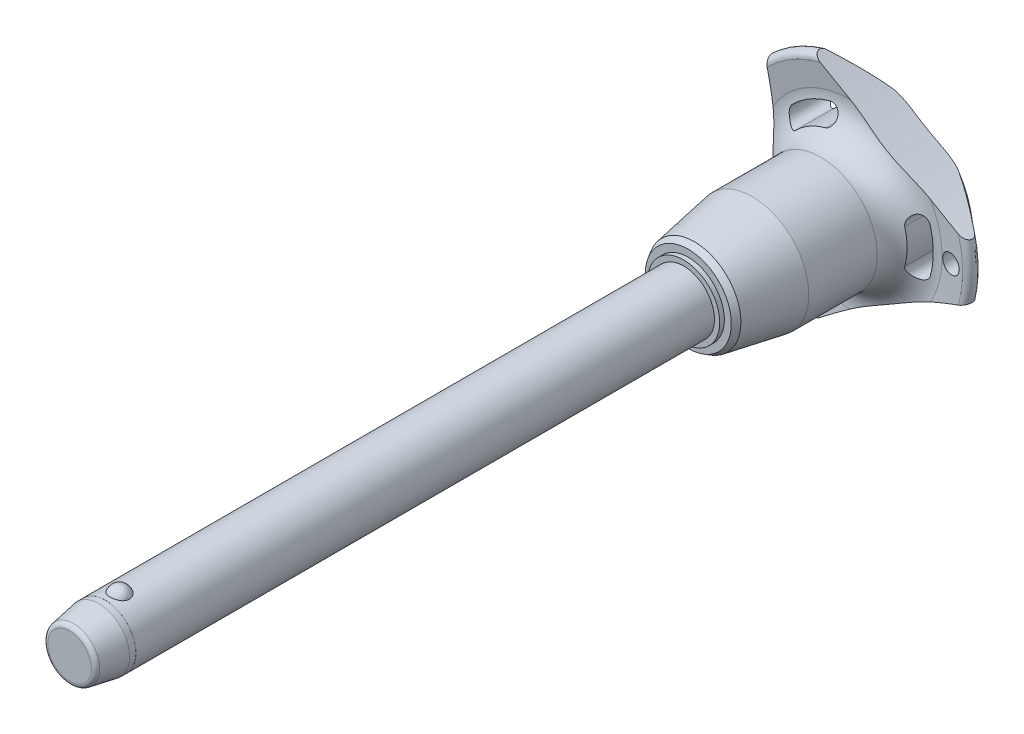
from build123d import *

# Parameters (mm, degrees)
SKETCH1_R           = 5
BOSS_EXTRUDE1_DEPTH = 90
SKETCH2_R           = 4.25
BOSS_EXTRUDE2_DEPTH = 33.3
BOSS_EXTRUDE3_START = 9.6
SKETCH1_2_R         = 5
BOSS_EXTRUDE3_DEPTH = 9.6
CHAMFER1_SIZE       = 4.8
CHAMFER1_SIZE2      = 0.846369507
FILLET1_R           = 0.75
SKETCH6_R           = 102.8
CUT_EXTRUDE1_DEPTH  = 127.380768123
CIRPATTERN1_COUNT   = 3
SKETCH7_R           = 1.5
CUT_EXTRUDE2_DEPTH  = 127.252726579
SKETCH8_R           = 5
SKETCH8_R_2         = 4.99
CUT_EXTRUDE3_DEPTH  = 5.76


with BuildPart() as part:
    # Sketch1 → Boss-Extrude1 (new body)
    with BuildSketch(Plane.XY):
        Circle(SKETCH1_R)
    extrude(amount=-BOSS_EXTRUDE1_DEPTH)

    # Sketch2 → Boss-Extrude2 (add)
    with BuildSketch(Plane(origin=(0, 0, -90), x_dir=(-1, 0, 0), z_dir=(0, 0, -1))):
        Circle(SKETCH2_R)
    extrude(amount=BOSS_EXTRUDE2_DEPTH)

    # Sketch3 → Revolve1 (revolve)
    with BuildSketch(Plane(origin=(0, 0, 0), x_dir=(0, 0, -1), z_dir=(1, 0, 0))):
        with BuildLine():
            Line((-1.516575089, 6), (-1.516575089, 2.7))
            ThreePointArc((-1.516575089, 2.7), (0.133424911, 4.35), (-1.516575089, 6))
        make_face()
        with BuildLine():
            Line((-1.516575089, -2.7), (-1.516575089, -6))
            ThreePointArc((-1.516575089, -6), (0.133424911, -4.35), (-1.516575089, -2.7))
        make_face()
    revolve(axis=Axis((0, -2.7, 1.516575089), (0, 1, 0)))

    # Sketch1_2 → Boss-Extrude3 (add)
    with BuildSketch(Plane.XY.offset(BOSS_EXTRUDE3_START)):
        Circle(SKETCH1_2_R)
    extrude(amount=-BOSS_EXTRUDE3_DEPTH)

    # Chamfer1
    chamfer1_edges = [part.edges().sort_by_distance(p)[0] for p in [
        (-5, 0, 9.6),
    ]]
    chamfer1_side = [part.faces().sort_by_distance(p)[0] for p in [
        (-5, 0, -40.2),
    ]]
    chamfer(chamfer1_edges, length=CHAMFER1_SIZE, length2=CHAMFER1_SIZE2, reference=chamfer1_side[0])

    # Fillet1
    fillet1_edges = [part.edges().sort_by_distance(p)[0] for p in [
        (-4.153630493, 0, 9.6),
        (4.25, 0, -123.3),
    ]]
    fillet(fillet1_edges, radius=FILLET1_R)

    # Sketch4 → Revolve2 (revolve)
    with BuildSketch(Plane(origin=(0, 0, 0), x_dir=(0, 0, -1), z_dir=(1, 0, 0)), mode=Mode.PRIVATE) as revolve2_sk:
        Polygon((90, 0), (90, 5.848880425), (90.75, 5.848880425), (90.75, 6.981619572), (91.730980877, 7.547989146), (101.1, 9.2), (112.2, 9.2), (112.2, 0), align=None)
    revolve(revolve2_sk.sketch.rotate(Axis((0, 0, -112.2), (0, 0, 1)), 90), axis=Axis((0, 0, -112.2), (0, 0, 1)))

    # Sketch5 → Revolve3 (revolve)
    with BuildSketch(Plane(origin=(0, 0, 0), x_dir=(0, 0, -1), z_dir=(1, 0, 0)), mode=Mode.PRIVATE) as revolve3_sk:
        with BuildLine():
            Line((117.169704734, 14.749576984), (116.756059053, 18.490084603))
            ThreePointArc((116.756059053, 18.490084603), (117.35677658, 19.519442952), (118.516044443, 19.24278761))
            Line((118.516044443, 19.24278761), (122.835691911, 14.094832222))
            ThreePointArc((122.835691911, 14.094832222), (123.3, 12.689260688), (122.67067517, 11.349423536))
            ThreePointArc((122.67067517, 11.349423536), (119.033110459, 6.185112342), (117.75, 0))
            Line((117.75, 0), (112.2, 0))
            Line((112.2, 0), (112.2, 9.2))
            ThreePointArc((112.2, 9.2), (115.924774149, 10.864425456), (117.169704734, 14.749576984))
        make_face()
    revolve(revolve3_sk.sketch.rotate(Axis((0, 0, -117.75), (0, 0, 1)), 90), axis=Axis((0, 0, -117.75), (0, 0, 1)))

    # Sketch6 → Cut-Extrude1 (cut, through all)
    with BuildSketch(Plane.XY):
        with Locations((-115.2, 0)):
            Circle(SKETCH6_R)
        with BuildLine():
            ThreePointArc((12.885043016, -3.538869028), (13.362182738, 0), (12.885043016, 3.538869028))
            ThreePointArc((12.885043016, 3.538869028), (11.179749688, 4.509281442), (10.209337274, 2.803988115))
            ThreePointArc((10.209337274, 2.803988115), (10.587394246, 0), (10.209337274, -2.803988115))
            ThreePointArc((10.209337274, -2.803988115), (11.179749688, -4.509281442), (12.885043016, -3.538869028))
        make_face()
    cut_extrude1 = extrude(amount=-CUT_EXTRUDE1_DEPTH, mode=Mode.SUBTRACT)

    # CirPattern1: Cut-Extrude1 ×3 about axis
    cirpattern1_axis = Axis((0, 0, 0), (0, 0, 1))
    for i in range(1, CIRPATTERN1_COUNT):
        add(cut_extrude1.rotate(cirpattern1_axis, i * 360 / CIRPATTERN1_COUNT), mode=Mode.SUBTRACT)

    # Sketch7 → Cut-Extrude2 (cut, through all)
    with BuildSketch(Plane.XY):
        with Locations(Location((16.362182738, 0, 0), (0, 0, 225.449470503))):
            Circle(SKETCH7_R)
    extrude(amount=-CUT_EXTRUDE2_DEPTH, mode=Mode.SUBTRACT)

    # Sketch8 → Cut-Extrude3 (cut)
    with BuildSketch(Plane.XY.offset(9.6)):
        Circle(SKETCH8_R)
        Circle(SKETCH8_R_2, mode=Mode.SUBTRACT)
    extrude(amount=-CUT_EXTRUDE3_DEPTH, mode=Mode.SUBTRACT)


solid = part.part
